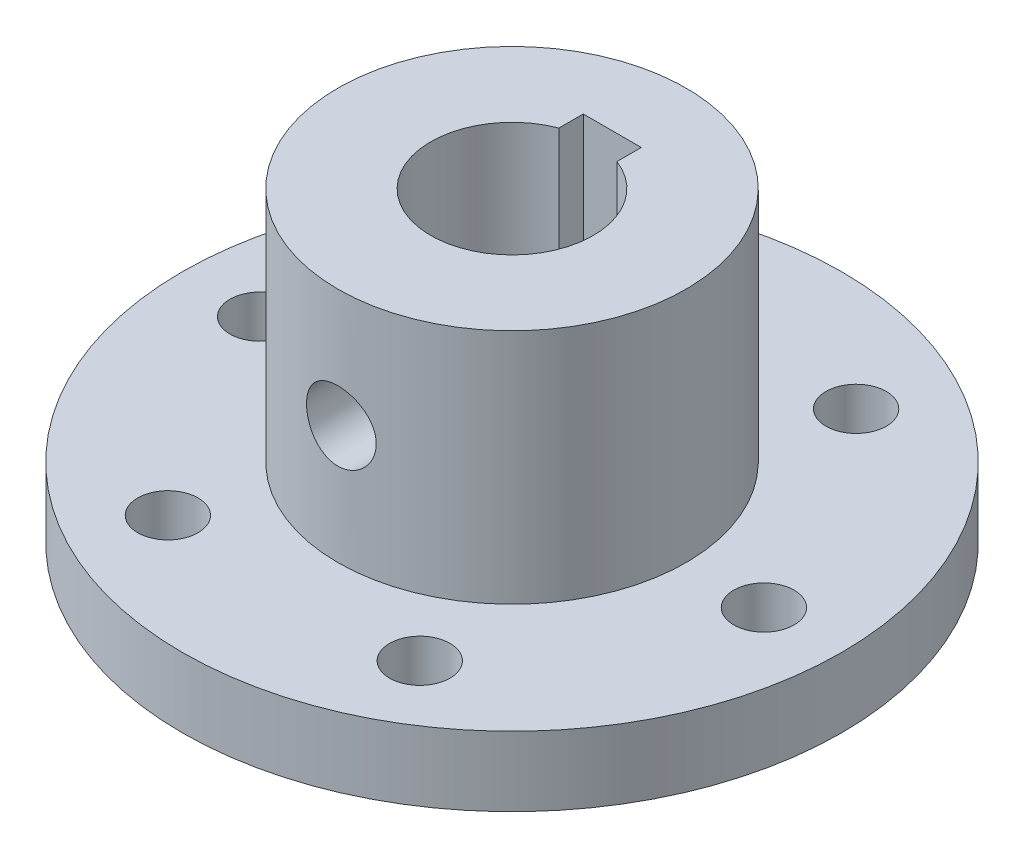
from build123d import *

# Parameters (mm, degrees)
SKETCH1_R           = 28.4
BOSS_EXTRUDE1_DEPTH = 6
SKETCH2_R           = 15
BOSS_EXTRUDE2_DEPTH = 20.4
CUT_EXTRUDE1_DEPTH  = 49.063291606
SKETCH4_R           = 3
CUT_EXTRUDE2_DEPTH  = 49.063291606
SKETCH5_R           = 2.6
CUT_EXTRUDE3_DEPTH  = 46.047530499
CIRPATTERN1_COUNT   = 6


with BuildPart() as part:
    # Sketch1 → Boss-Extrude1 (new body)
    with BuildSketch(Plane(origin=(0, 0, 0), x_dir=(1, 0, 0), z_dir=(0, 1, 0))):
        with Locations(Location((0, 0, 0), (0, 0, 270))):
            Circle(SKETCH1_R)
    extrude(amount=BOSS_EXTRUDE1_DEPTH)

    # Sketch2 → Boss-Extrude2 (add)
    with BuildSketch(Plane(origin=(0, 6, 0), x_dir=(1, 0, 0), z_dir=(0, 1, 0))):
        with Locations(Location((0, 0, 0), (0, 0, 270))):
            Circle(SKETCH2_R)
    extrude(amount=BOSS_EXTRUDE2_DEPTH)

    # Sketch3 → Cut-Extrude1 (cut, through all)
    with BuildSketch(Plane(origin=(0, 26.4, 0), x_dir=(1, 0, 0), z_dir=(0, 1, 0))):
        with BuildLine():
            Line((-2.5, 8.638348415), (2.5, 8.638348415))
            Line((2.5, 8.638348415), (2.5, 6.538348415))
            ThreePointArc((2.5, 6.538348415), (0, -7), (-2.5, 6.538348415))
            Line((-2.5, 6.538348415), (-2.5, 8.638348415))
        make_face()
    extrude(amount=-CUT_EXTRUDE1_DEPTH, mode=Mode.SUBTRACT)

    # Sketch4 → Cut-Extrude2 (cut, through all)
    with BuildSketch(Plane.XY):
        with Locations(Location((0, 16.2, 0), (0, 0, 180))):
            Circle(SKETCH4_R)
    extrude(amount=CUT_EXTRUDE2_DEPTH, mode=Mode.SUBTRACT)

    # Sketch5 → Cut-Extrude3 (cut, through all)
    with BuildSketch(Plane(origin=(0, 6, 0), x_dir=(1, 0, 0), z_dir=(0, 1, 0))):
        with Locations(Location((-21.7, 0, 0), (0, 0, 270))):
            Circle(SKETCH5_R)
    cut_extrude3 = extrude(amount=-CUT_EXTRUDE3_DEPTH, mode=Mode.SUBTRACT)

    # CirPattern1: Cut-Extrude3 ×6 about axis
    cirpattern1_axis = Axis((0, 0, 0), (0, 1, 0))
    for i in range(1, CIRPATTERN1_COUNT):
        add(cut_extrude3.rotate(cirpattern1_axis, i * 360 / CIRPATTERN1_COUNT), mode=Mode.SUBTRACT)


solid = part.part
